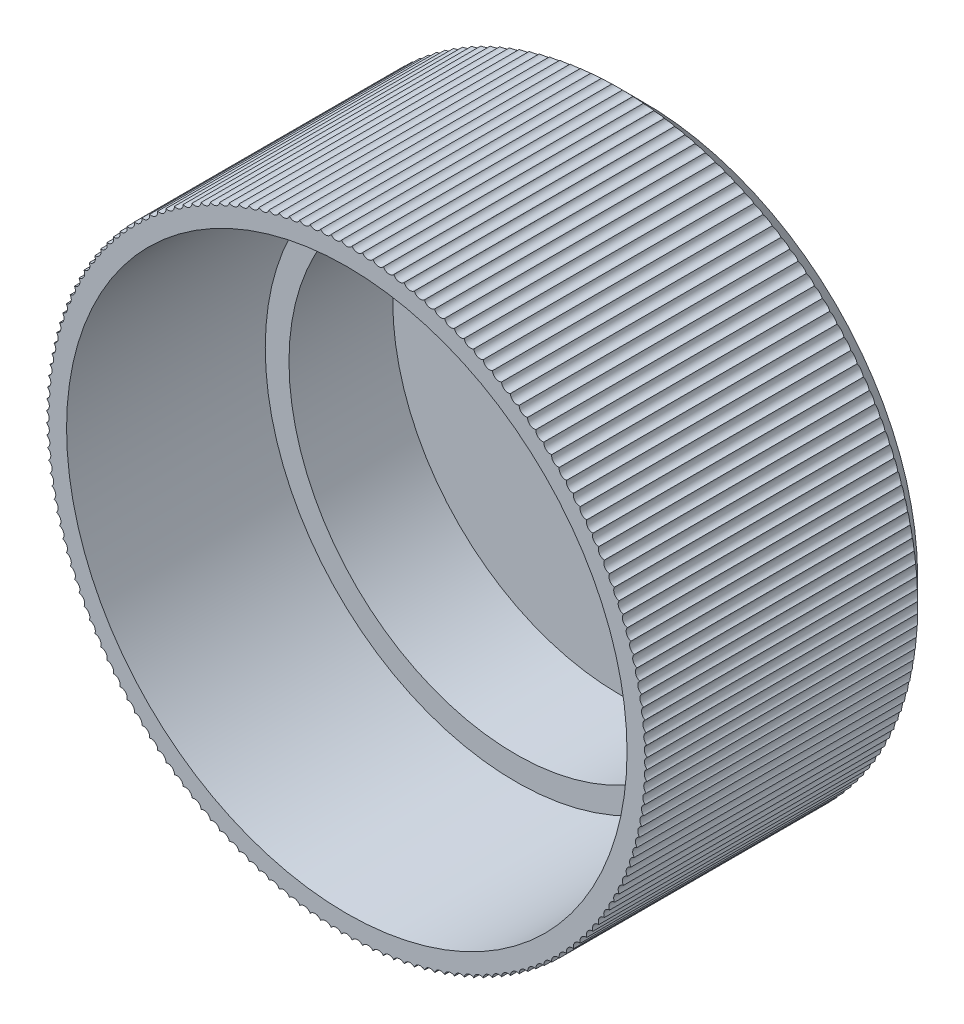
from build123d import *

# Parameters (mm, degrees)
ESQUISSE1_R                  = 10.25
BASE_EXTRUSION_DEPTH         = 10
COQUE1_T                     = -0.8
CHANFREIN1_SIZE              = 1
ENL_V_MAT_EXTRU_1_DEPTH      = 18.610366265
R_P_TITION_CIRCULAIRE1_COUNT = 180


with BuildPart() as part:
    # Esquisse1 → Base-Extrusion (new body)
    with BuildSketch(Plane.XY):
        Circle(ESQUISSE1_R)
    extrude(amount=BASE_EXTRUSION_DEPTH)

    # Coque1
    coque1_openings = [part.faces().sort_by_distance(p)[0] for p in [
        (0, 0, 10),
    ]]
    offset(amount=COQUE1_T, openings=coque1_openings, kind=Kind.INTERSECTION)

    # Esquisse2 → Boss.-R_vol.1 (revolve)
    with BuildSketch(Plane(origin=(0, 0, 0), x_dir=(1, 0, 0), z_dir=(0, 1, 0))):
        Polygon((-9.45, -0.8), (-7.65, -0.8), (-7.65, -4.3), (-8.45, -4.3), (-8.45, -2.3), (-9.45, -2.3), align=None)
    revolve(axis=Axis((0, 0, -2.924100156), (0, 0, 1)))

    # Chanfrein1
    chanfrein1_edges = [part.edges().sort_by_distance(p)[0] for p in [
        (-10.25, 0, 0),
    ]]
    chamfer(chanfrein1_edges, length=CHANFREIN1_SIZE)

    # Esquisse4 → Enl_v. mat.-Extru.1 (cut, through all)
    with BuildSketch(Plane.XY.offset(10)):
        with BuildLine():
            ThreePointArc((-0.212566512, 10.24779564), (0, 10.037422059), (0.212566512, 10.24779564))
            ThreePointArc((0.212566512, 10.24779564), (0, 10.25), (-0.212566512, 10.24779564))
        make_face()
    enl_v_mat_extru_1 = extrude(amount=-ENL_V_MAT_EXTRU_1_DEPTH, mode=Mode.SUBTRACT)

    # R_p_tition circulaire1: Enl_v. mat.-Extru.1 ×180 about axis
    r_p_tition_circulaire1_axis = Axis((0, 0, 0), (0, 0, 1))
    for i in range(1, R_P_TITION_CIRCULAIRE1_COUNT):
        add(enl_v_mat_extru_1.rotate(r_p_tition_circulaire1_axis, i * 360 / R_P_TITION_CIRCULAIRE1_COUNT), mode=Mode.SUBTRACT)


solid = part.part
